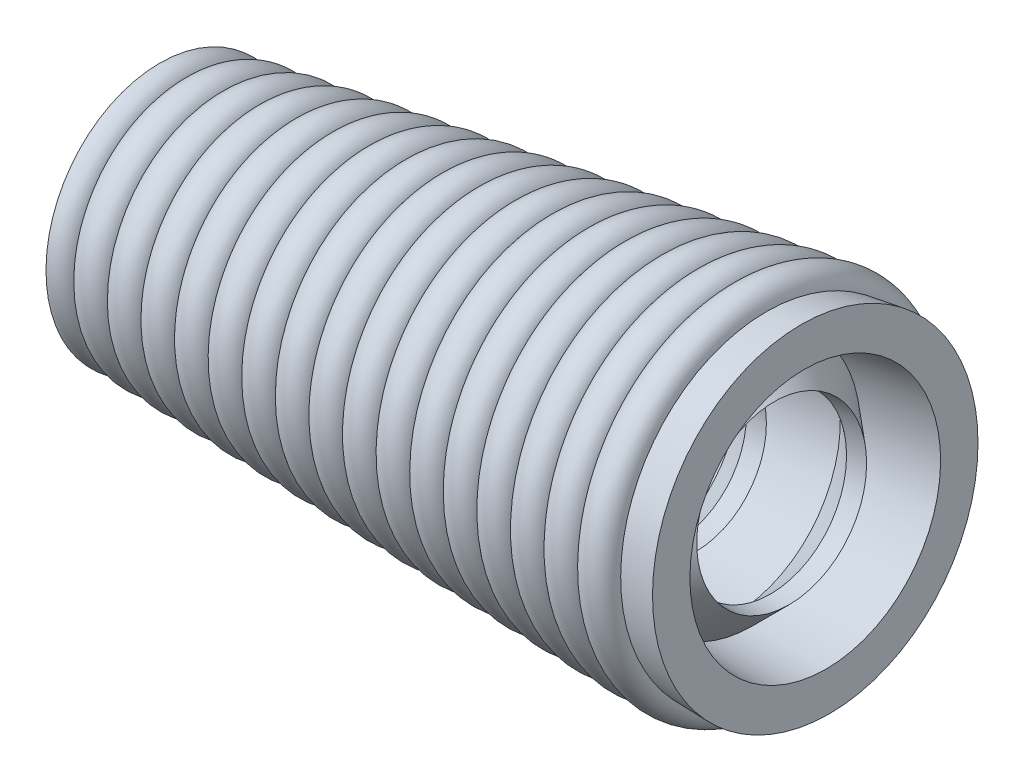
ISO-10303-21;
HEADER;
FILE_DESCRIPTION(('STEP AP214'),'2;1');
FILE_NAME('part.step','',(''),(''),'','','');
FILE_SCHEMA(('AUTOMOTIVE_DESIGN { 1 0 10303 214 1 1 1 1 }'));
ENDSEC;
DATA;
#1=APPLICATION_CONTEXT('core data for automotive mechanical design processes');
#2=APPLICATION_PROTOCOL_DEFINITION('international standard','automotive_design',2000,#1);
#3=PRODUCT_CONTEXT('',#1,'mechanical');
#4=PRODUCT('Part','Part','',(#3));
#5=PRODUCT_RELATED_PRODUCT_CATEGORY('part','',(#4));
#6=PRODUCT_DEFINITION_FORMATION('','',#4);
#7=PRODUCT_DEFINITION_CONTEXT('part definition',#1,'design');
#8=PRODUCT_DEFINITION('design','',#6,#7);
#9=PRODUCT_DEFINITION_SHAPE('','',#8);
#10=(LENGTH_UNIT() NAMED_UNIT(*) SI_UNIT(.MILLI.,.METRE.));
#11=(NAMED_UNIT(*) PLANE_ANGLE_UNIT() SI_UNIT($,.RADIAN.));
#12=(NAMED_UNIT(*) SI_UNIT($,.STERADIAN.) SOLID_ANGLE_UNIT());
#13=UNCERTAINTY_MEASURE_WITH_UNIT(LENGTH_MEASURE(1.E-05),#10,'distance_accuracy_value','');
#14=(GEOMETRIC_REPRESENTATION_CONTEXT(3) GLOBAL_UNCERTAINTY_ASSIGNED_CONTEXT((#13)) GLOBAL_UNIT_ASSIGNED_CONTEXT((#10,
#11,#12)) REPRESENTATION_CONTEXT('',''));
#15=CARTESIAN_POINT('',(0.,0.,0.));
#16=DIRECTION('',(0.,0.,1.));
#17=DIRECTION('',(1.,0.,0.));
#18=AXIS2_PLACEMENT_3D('',#15,#16,#17);
#19=CARTESIAN_POINT('',(200.828415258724,20.7573376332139,0.));
#20=DIRECTION('',(0.996194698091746,0.0871557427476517,0.));
#21=DIRECTION('',(-0.0871557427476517,0.996194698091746,0.));
#22=AXIS2_PLACEMENT_3D('',#19,#20,#21);
#23=CONICAL_SURFACE('',#22,27.2108832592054,0.0872664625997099);
#24=CARTESIAN_POINT('',(200.828415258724,20.7573376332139,0.));
#25=DIRECTION('',(-0.996194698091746,-0.0871557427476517,0.));
#26=DIRECTION('',(0.0871557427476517,-0.996194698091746,0.));
#27=AXIS2_PLACEMENT_3D('',#24,#25,#26);
#28=CIRCLE('',#27,27.2108832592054);
#29=CARTESIAN_POINT('',(203.2,-6.34999999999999,0.));
#30=VERTEX_POINT('',#29);
#31=EDGE_CURVE('E167',#30,#30,#28,.T.);
#32=ORIENTED_EDGE('',*,*,#31,.F.);
#33=EDGE_LOOP('',(#32));
#34=FACE_BOUND('',#33,.T.);
#35=CARTESIAN_POINT('',(206.799924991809,21.2797770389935,0.));
#36=DIRECTION('',(0.996194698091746,0.0871557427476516,0.));
#37=DIRECTION('',(-0.0871557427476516,0.996194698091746,0.));
#38=AXIS2_PLACEMENT_3D('',#35,#36,#37);
#39=CIRCLE('',#38,27.7353182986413);
#40=CARTESIAN_POINT('',(204.382632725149,48.909554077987,0.));
#41=VERTEX_POINT('',#40);
#42=EDGE_CURVE('E47',#41,#41,#39,.F.);
#43=ORIENTED_EDGE('',*,*,#42,.T.);
#44=EDGE_LOOP('',(#43));
#45=FACE_BOUND('',#44,.T.);
#46=ADVANCED_FACE('F43',(#34,#45),#23,.T.);
#47=CARTESIAN_POINT('',(103.372141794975,12.2310185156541,0.));
#48=DIRECTION('',(-0.996194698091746,-0.0871557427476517,0.));
#49=DIRECTION('',(0.0871557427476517,-0.996194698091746,0.));
#50=AXIS2_PLACEMENT_3D('',#47,#48,#49);
#51=CONICAL_SURFACE('',#50,5.9034830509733,0.69813170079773);
#52=CARTESIAN_POINT('',(96.5190442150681,11.6314501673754,0.));
#53=DIRECTION('',(0.996194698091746,0.0871557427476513,0.));
#54=DIRECTION('',(-0.0871557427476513,0.996194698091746,0.));
#55=AXIS2_PLACEMENT_3D('',#52,#53,#54);
#56=CIRCLE('',#55,11.6758804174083);
#57=CARTESIAN_POINT('',(95.5014241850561,23.2629003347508,0.));
#58=VERTEX_POINT('',#57);
#59=EDGE_CURVE('E235',#58,#58,#56,.T.);
#60=ORIENTED_EDGE('',*,*,#59,.F.);
#61=EDGE_LOOP('',(#60));
#62=FACE_BOUND('',#61,.T.);
#63=CARTESIAN_POINT('',(103.372141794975,12.2310185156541,0.));
#64=DIRECTION('',(-0.996194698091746,-0.0871557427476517,0.));
#65=DIRECTION('',(0.0871557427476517,-0.996194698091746,0.));
#66=AXIS2_PLACEMENT_3D('',#63,#64,#65);
#67=CIRCLE('',#66,5.9034830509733);
#68=CARTESIAN_POINT('',(103.88666424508,6.35,0.));
#69=VERTEX_POINT('',#68);
#70=EDGE_CURVE('E52',#69,#69,#67,.T.);
#71=ORIENTED_EDGE('',*,*,#70,.F.);
#72=EDGE_LOOP('',(#71));
#73=FACE_BOUND('',#72,.T.);
#74=ADVANCED_FACE('F45',(#62,#73),#51,.F.);
#75=CARTESIAN_POINT('',(106.523024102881,12.5066849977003,0.));
#76=DIRECTION('',(0.996194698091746,0.0871557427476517,0.));
#77=DIRECTION('',(-0.0871557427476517,0.996194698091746,0.));
#78=AXIS2_PLACEMENT_3D('',#75,#76,#77);
#79=CONICAL_SURFACE('',#78,6.18020253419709,0.08726646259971);
#80=ORIENTED_EDGE('',*,*,#70,.T.);
#81=EDGE_LOOP('',(#80));
#82=FACE_BOUND('',#81,.T.);
#83=CARTESIAN_POINT('',(106.523024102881,12.5066849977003,0.));
#84=DIRECTION('',(-0.996194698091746,-0.0871557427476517,0.));
#85=DIRECTION('',(0.0871557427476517,-0.996194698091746,0.));
#86=AXIS2_PLACEMENT_3D('',#83,#84,#85);
#87=CIRCLE('',#86,6.18020253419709);
#88=CARTESIAN_POINT('',(107.06166424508,6.35,0.));
#89=VERTEX_POINT('',#88);
#90=EDGE_CURVE('E57',#89,#89,#87,.T.);
#91=ORIENTED_EDGE('',*,*,#90,.F.);
#92=EDGE_LOOP('',(#91));
#93=FACE_BOUND('',#92,.T.);
#94=ADVANCED_FACE('F261',(#82,#93),#79,.F.);
#95=CARTESIAN_POINT('',(99.6699265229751,11.9071166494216,0.));
#96=DIRECTION('',(-0.996194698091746,-0.0871557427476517,0.));
#97=DIRECTION('',(0.0871557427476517,-0.996194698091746,0.));
#98=AXIS2_PLACEMENT_3D('',#95,#96,#97);
#99=CONICAL_SURFACE('',#98,11.9525999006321,0.698131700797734);
#100=ORIENTED_EDGE('',*,*,#90,.T.);
#101=EDGE_LOOP('',(#100));
#102=FACE_BOUND('',#101,.T.);
#103=CARTESIAN_POINT('',(99.6699265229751,11.9071166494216,0.));
#104=DIRECTION('',(-0.996194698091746,-0.0871557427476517,0.));
#105=DIRECTION('',(0.0871557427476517,-0.996194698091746,0.));
#106=AXIS2_PLACEMENT_3D('',#103,#104,#105);
#107=CIRCLE('',#106,11.9525999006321);
#108=CARTESIAN_POINT('',(100.71166424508,0.,0.));
#109=VERTEX_POINT('',#108);
#110=EDGE_CURVE('E63',#109,#109,#107,.T.);
#111=ORIENTED_EDGE('',*,*,#110,.F.);
#112=EDGE_LOOP('',(#111));
#113=FACE_BOUND('',#112,.T.);
#114=ADVANCED_FACE('F367',(#102,#113),#99,.T.);
#115=CARTESIAN_POINT('',(112.273455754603,13.0097825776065,0.));
#116=DIRECTION('',(0.996194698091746,0.0871557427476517,0.));
#117=DIRECTION('',(-0.0871557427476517,0.996194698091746,0.));
#118=AXIS2_PLACEMENT_3D('',#115,#116,#117);
#119=CONICAL_SURFACE('',#118,13.0594778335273,0.0872664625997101);
#120=ORIENTED_EDGE('',*,*,#110,.T.);
#121=EDGE_LOOP('',(#120));
#122=FACE_BOUND('',#121,.T.);
#123=CARTESIAN_POINT('',(112.273455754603,13.0097825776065,0.));
#124=DIRECTION('',(-0.996194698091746,-0.0871557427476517,0.));
#125=DIRECTION('',(0.0871557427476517,-0.996194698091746,0.));
#126=AXIS2_PLACEMENT_3D('',#123,#124,#125);
#127=CIRCLE('',#126,13.0594778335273);
#128=CARTESIAN_POINT('',(113.41166424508,0.,0.));
#129=VERTEX_POINT('',#128);
#130=EDGE_CURVE('E67',#129,#129,#127,.T.);
#131=ORIENTED_EDGE('',*,*,#130,.F.);
#132=EDGE_LOOP('',(#131));
#133=FACE_BOUND('',#132,.T.);
#134=ADVANCED_FACE('F363',(#122,#133),#119,.F.);
#135=CARTESIAN_POINT('',(119.126553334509,13.6093509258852,0.));
#136=DIRECTION('',(-0.996194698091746,-0.0871557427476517,0.));
#137=DIRECTION('',(0.0871557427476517,-0.996194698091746,0.));
#138=AXIS2_PLACEMENT_3D('',#135,#136,#137);
#139=CONICAL_SURFACE('',#138,7.28708046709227,0.698131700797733);
#140=ORIENTED_EDGE('',*,*,#130,.T.);
#141=EDGE_LOOP('',(#140));
#142=FACE_BOUND('',#141,.T.);
#143=CARTESIAN_POINT('',(119.126553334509,13.6093509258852,0.));
#144=DIRECTION('',(-0.996194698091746,-0.0871557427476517,0.));
#145=DIRECTION('',(0.0871557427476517,-0.996194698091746,0.));
#146=AXIS2_PLACEMENT_3D('',#143,#144,#145);
#147=CIRCLE('',#146,7.28708046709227);
#148=CARTESIAN_POINT('',(119.76166424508,6.35,0.));
#149=VERTEX_POINT('',#148);
#150=EDGE_CURVE('E71',#149,#149,#147,.T.);
#151=ORIENTED_EDGE('',*,*,#150,.F.);
#152=EDGE_LOOP('',(#151));
#153=FACE_BOUND('',#152,.T.);
#154=ADVANCED_FACE('F359',(#142,#153),#139,.F.);
#155=CARTESIAN_POINT('',(122.277435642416,13.8850174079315,0.));
#156=DIRECTION('',(0.996194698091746,0.0871557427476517,0.));
#157=DIRECTION('',(-0.0871557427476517,0.996194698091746,0.));
#158=AXIS2_PLACEMENT_3D('',#155,#156,#157);
#159=CONICAL_SURFACE('',#158,7.56379995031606,0.0872664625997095);
#160=ORIENTED_EDGE('',*,*,#150,.T.);
#161=EDGE_LOOP('',(#160));
#162=FACE_BOUND('',#161,.T.);
#163=CARTESIAN_POINT('',(122.277435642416,13.8850174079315,0.));
#164=DIRECTION('',(-0.996194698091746,-0.0871557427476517,0.));
#165=DIRECTION('',(0.0871557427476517,-0.996194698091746,0.));
#166=AXIS2_PLACEMENT_3D('',#163,#164,#165);
#167=CIRCLE('',#166,7.56379995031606);
#168=CARTESIAN_POINT('',(122.93666424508,6.35,0.));
#169=VERTEX_POINT('',#168);
#170=EDGE_CURVE('E75',#169,#169,#167,.T.);
#171=ORIENTED_EDGE('',*,*,#170,.F.);
#172=EDGE_LOOP('',(#171));
#173=FACE_BOUND('',#172,.T.);
#174=ADVANCED_FACE('F355',(#162,#173),#159,.F.);
#175=CARTESIAN_POINT('',(115.424338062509,13.2854490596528,0.));
#176=DIRECTION('',(-0.996194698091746,-0.0871557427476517,0.));
#177=DIRECTION('',(0.0871557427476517,-0.996194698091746,0.));
#178=AXIS2_PLACEMENT_3D('',#175,#176,#177);
#179=CONICAL_SURFACE('',#178,13.3361973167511,0.698131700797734);
#180=ORIENTED_EDGE('',*,*,#170,.T.);
#181=EDGE_LOOP('',(#180));
#182=FACE_BOUND('',#181,.T.);
#183=CARTESIAN_POINT('',(115.424338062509,13.2854490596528,0.));
#184=DIRECTION('',(-0.996194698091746,-0.0871557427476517,0.));
#185=DIRECTION('',(0.0871557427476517,-0.996194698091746,0.));
#186=AXIS2_PLACEMENT_3D('',#183,#184,#185);
#187=CIRCLE('',#186,13.3361973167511);
#188=CARTESIAN_POINT('',(116.58666424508,0.,0.));
#189=VERTEX_POINT('',#188);
#190=EDGE_CURVE('E79',#189,#189,#187,.T.);
#191=ORIENTED_EDGE('',*,*,#190,.F.);
#192=EDGE_LOOP('',(#191));
#193=FACE_BOUND('',#192,.T.);
#194=ADVANCED_FACE('F351',(#182,#193),#179,.T.);
#195=CARTESIAN_POINT('',(128.027867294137,14.3881149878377,0.));
#196=DIRECTION('',(0.996194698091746,0.0871557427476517,0.));
#197=DIRECTION('',(-0.0871557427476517,0.996194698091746,0.));
#198=AXIS2_PLACEMENT_3D('',#195,#196,#197);
#199=CONICAL_SURFACE('',#198,14.4430752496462,0.0872664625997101);
#200=ORIENTED_EDGE('',*,*,#190,.T.);
#201=EDGE_LOOP('',(#200));
#202=FACE_BOUND('',#201,.T.);
#203=CARTESIAN_POINT('',(128.027867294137,14.3881149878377,0.));
#204=DIRECTION('',(-0.996194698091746,-0.0871557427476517,0.));
#205=DIRECTION('',(0.0871557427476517,-0.996194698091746,0.));
#206=AXIS2_PLACEMENT_3D('',#203,#204,#205);
#207=CIRCLE('',#206,14.4430752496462);
#208=CARTESIAN_POINT('',(129.28666424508,0.,0.));
#209=VERTEX_POINT('',#208);
#210=EDGE_CURVE('E83',#209,#209,#207,.T.);
#211=ORIENTED_EDGE('',*,*,#210,.F.);
#212=EDGE_LOOP('',(#211));
#213=FACE_BOUND('',#212,.T.);
#214=ADVANCED_FACE('F347',(#202,#213),#199,.F.);
#215=CARTESIAN_POINT('',(134.880964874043,14.9876833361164,0.));
#216=DIRECTION('',(-0.996194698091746,-0.0871557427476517,0.));
#217=DIRECTION('',(0.0871557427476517,-0.996194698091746,0.));
#218=AXIS2_PLACEMENT_3D('',#215,#216,#217);
#219=CONICAL_SURFACE('',#218,8.67067788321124,0.698131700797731);
#220=ORIENTED_EDGE('',*,*,#210,.T.);
#221=EDGE_LOOP('',(#220));
#222=FACE_BOUND('',#221,.T.);
#223=CARTESIAN_POINT('',(134.880964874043,14.9876833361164,0.));
#224=DIRECTION('',(-0.996194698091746,-0.0871557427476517,0.));
#225=DIRECTION('',(0.0871557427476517,-0.996194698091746,0.));
#226=AXIS2_PLACEMENT_3D('',#223,#224,#225);
#227=CIRCLE('',#226,8.67067788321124);
#228=CARTESIAN_POINT('',(135.63666424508,6.35,0.));
#229=VERTEX_POINT('',#228);
#230=EDGE_CURVE('E87',#229,#229,#227,.T.);
#231=ORIENTED_EDGE('',*,*,#230,.F.);
#232=EDGE_LOOP('',(#231));
#233=FACE_BOUND('',#232,.T.);
#234=ADVANCED_FACE('F343',(#222,#233),#219,.F.);
#235=CARTESIAN_POINT('',(138.03184718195,15.2633498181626,0.));
#236=DIRECTION('',(0.996194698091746,0.0871557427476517,0.));
#237=DIRECTION('',(-0.0871557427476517,0.996194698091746,0.));
#238=AXIS2_PLACEMENT_3D('',#235,#236,#237);
#239=CONICAL_SURFACE('',#238,8.94739736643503,0.0872664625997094);
#240=ORIENTED_EDGE('',*,*,#230,.T.);
#241=EDGE_LOOP('',(#240));
#242=FACE_BOUND('',#241,.T.);
#243=CARTESIAN_POINT('',(138.03184718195,15.2633498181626,0.));
#244=DIRECTION('',(-0.996194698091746,-0.0871557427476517,0.));
#245=DIRECTION('',(0.0871557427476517,-0.996194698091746,0.));
#246=AXIS2_PLACEMENT_3D('',#243,#244,#245);
#247=CIRCLE('',#246,8.94739736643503);
#248=CARTESIAN_POINT('',(138.81166424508,6.35,0.));
#249=VERTEX_POINT('',#248);
#250=EDGE_CURVE('E91',#249,#249,#247,.T.);
#251=ORIENTED_EDGE('',*,*,#250,.F.);
#252=EDGE_LOOP('',(#251));
#253=FACE_BOUND('',#252,.T.);
#254=ADVANCED_FACE('F339',(#242,#253),#239,.F.);
#255=CARTESIAN_POINT('',(131.178749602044,14.6637814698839,0.));
#256=DIRECTION('',(-0.996194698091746,-0.0871557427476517,0.));
#257=DIRECTION('',(0.0871557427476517,-0.996194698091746,0.));
#258=AXIS2_PLACEMENT_3D('',#255,#256,#257);
#259=CONICAL_SURFACE('',#258,14.71979473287,0.698131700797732);
#260=ORIENTED_EDGE('',*,*,#250,.T.);
#261=EDGE_LOOP('',(#260));
#262=FACE_BOUND('',#261,.T.);
#263=CARTESIAN_POINT('',(131.178749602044,14.6637814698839,0.));
#264=DIRECTION('',(-0.996194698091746,-0.0871557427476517,0.));
#265=DIRECTION('',(0.0871557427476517,-0.996194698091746,0.));
#266=AXIS2_PLACEMENT_3D('',#263,#264,#265);
#267=CIRCLE('',#266,14.71979473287);
#268=CARTESIAN_POINT('',(132.46166424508,0.,0.));
#269=VERTEX_POINT('',#268);
#270=EDGE_CURVE('E95',#269,#269,#267,.T.);
#271=ORIENTED_EDGE('',*,*,#270,.F.);
#272=EDGE_LOOP('',(#271));
#273=FACE_BOUND('',#272,.T.);
#274=ADVANCED_FACE('F335',(#262,#273),#259,.T.);
#275=CARTESIAN_POINT('',(143.782278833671,15.7664473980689,0.));
#276=DIRECTION('',(0.996194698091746,0.0871557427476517,0.));
#277=DIRECTION('',(-0.0871557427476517,0.996194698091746,0.));
#278=AXIS2_PLACEMENT_3D('',#275,#276,#277);
#279=CONICAL_SURFACE('',#278,15.8266726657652,0.0872664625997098);
#280=ORIENTED_EDGE('',*,*,#270,.T.);
#281=EDGE_LOOP('',(#280));
#282=FACE_BOUND('',#281,.T.);
#283=CARTESIAN_POINT('',(143.782278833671,15.7664473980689,0.));
#284=DIRECTION('',(-0.996194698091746,-0.0871557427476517,0.));
#285=DIRECTION('',(0.0871557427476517,-0.996194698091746,0.));
#286=AXIS2_PLACEMENT_3D('',#283,#284,#285);
#287=CIRCLE('',#286,15.8266726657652);
#288=CARTESIAN_POINT('',(145.16166424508,0.,0.));
#289=VERTEX_POINT('',#288);
#290=EDGE_CURVE('E99',#289,#289,#287,.T.);
#291=ORIENTED_EDGE('',*,*,#290,.F.);
#292=EDGE_LOOP('',(#291));
#293=FACE_BOUND('',#292,.T.);
#294=ADVANCED_FACE('F331',(#282,#293),#279,.F.);
#295=CARTESIAN_POINT('',(150.635376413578,16.3660157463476,0.));
#296=DIRECTION('',(-0.996194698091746,-0.0871557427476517,0.));
#297=DIRECTION('',(0.0871557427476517,-0.996194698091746,0.));
#298=AXIS2_PLACEMENT_3D('',#295,#296,#297);
#299=CONICAL_SURFACE('',#298,10.0542752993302,0.698131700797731);
#300=ORIENTED_EDGE('',*,*,#290,.T.);
#301=EDGE_LOOP('',(#300));
#302=FACE_BOUND('',#301,.T.);
#303=CARTESIAN_POINT('',(150.635376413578,16.3660157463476,0.));
#304=DIRECTION('',(-0.996194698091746,-0.0871557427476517,0.));
#305=DIRECTION('',(0.0871557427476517,-0.996194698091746,0.));
#306=AXIS2_PLACEMENT_3D('',#303,#304,#305);
#307=CIRCLE('',#306,10.0542752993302);
#308=CARTESIAN_POINT('',(151.51166424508,6.35,0.));
#309=VERTEX_POINT('',#308);
#310=EDGE_CURVE('E103',#309,#309,#307,.T.);
#311=ORIENTED_EDGE('',*,*,#310,.F.);
#312=EDGE_LOOP('',(#311));
#313=FACE_BOUND('',#312,.T.);
#314=ADVANCED_FACE('F327',(#302,#313),#299,.F.);
#315=CARTESIAN_POINT('',(153.786258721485,16.6416822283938,0.));
#316=DIRECTION('',(0.996194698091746,0.0871557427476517,0.));
#317=DIRECTION('',(-0.0871557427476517,0.996194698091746,0.));
#318=AXIS2_PLACEMENT_3D('',#315,#316,#317);
#319=CONICAL_SURFACE('',#318,10.330994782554,0.0872664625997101);
#320=ORIENTED_EDGE('',*,*,#310,.T.);
#321=EDGE_LOOP('',(#320));
#322=FACE_BOUND('',#321,.T.);
#323=CARTESIAN_POINT('',(153.786258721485,16.6416822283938,0.));
#324=DIRECTION('',(-0.996194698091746,-0.0871557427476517,0.));
#325=DIRECTION('',(0.0871557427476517,-0.996194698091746,0.));
#326=AXIS2_PLACEMENT_3D('',#323,#324,#325);
#327=CIRCLE('',#326,10.330994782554);
#328=CARTESIAN_POINT('',(154.68666424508,6.35,0.));
#329=VERTEX_POINT('',#328);
#330=EDGE_CURVE('E107',#329,#329,#327,.T.);
#331=ORIENTED_EDGE('',*,*,#330,.F.);
#332=EDGE_LOOP('',(#331));
#333=FACE_BOUND('',#332,.T.);
#334=ADVANCED_FACE('F323',(#322,#333),#319,.F.);
#335=CARTESIAN_POINT('',(146.933161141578,16.0421138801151,0.));
#336=DIRECTION('',(-0.996194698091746,-0.0871557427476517,0.));
#337=DIRECTION('',(0.0871557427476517,-0.996194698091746,0.));
#338=AXIS2_PLACEMENT_3D('',#335,#336,#337);
#339=CONICAL_SURFACE('',#338,16.103392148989,0.698131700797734);
#340=ORIENTED_EDGE('',*,*,#330,.T.);
#341=EDGE_LOOP('',(#340));
#342=FACE_BOUND('',#341,.T.);
#343=CARTESIAN_POINT('',(146.933161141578,16.0421138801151,0.));
#344=DIRECTION('',(-0.996194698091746,-0.0871557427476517,0.));
#345=DIRECTION('',(0.0871557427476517,-0.996194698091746,0.));
#346=AXIS2_PLACEMENT_3D('',#343,#344,#345);
#347=CIRCLE('',#346,16.103392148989);
#348=CARTESIAN_POINT('',(148.33666424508,0.,0.));
#349=VERTEX_POINT('',#348);
#350=EDGE_CURVE('E111',#349,#349,#347,.T.);
#351=ORIENTED_EDGE('',*,*,#350,.F.);
#352=EDGE_LOOP('',(#351));
#353=FACE_BOUND('',#352,.T.);
#354=ADVANCED_FACE('F319',(#342,#353),#339,.T.);
#355=CARTESIAN_POINT('',(159.536690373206,17.1447798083,0.));
#356=DIRECTION('',(0.996194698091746,0.0871557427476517,0.));
#357=DIRECTION('',(-0.0871557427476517,0.996194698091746,0.));
#358=AXIS2_PLACEMENT_3D('',#355,#356,#357);
#359=CONICAL_SURFACE('',#358,17.2102700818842,0.0872664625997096);
#360=ORIENTED_EDGE('',*,*,#350,.T.);
#361=EDGE_LOOP('',(#360));
#362=FACE_BOUND('',#361,.T.);
#363=CARTESIAN_POINT('',(159.536690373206,17.1447798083,0.));
#364=DIRECTION('',(-0.996194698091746,-0.0871557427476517,0.));
#365=DIRECTION('',(0.0871557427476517,-0.996194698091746,0.));
#366=AXIS2_PLACEMENT_3D('',#363,#364,#365);
#367=CIRCLE('',#366,17.2102700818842);
#368=CARTESIAN_POINT('',(161.03666424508,0.,0.));
#369=VERTEX_POINT('',#368);
#370=EDGE_CURVE('E115',#369,#369,#367,.T.);
#371=ORIENTED_EDGE('',*,*,#370,.F.);
#372=EDGE_LOOP('',(#371));
#373=FACE_BOUND('',#372,.T.);
#374=ADVANCED_FACE('F315',(#362,#373),#359,.F.);
#375=CARTESIAN_POINT('',(166.389787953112,17.7443481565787,0.));
#376=DIRECTION('',(-0.996194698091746,-0.0871557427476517,0.));
#377=DIRECTION('',(0.0871557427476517,-0.996194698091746,0.));
#378=AXIS2_PLACEMENT_3D('',#375,#376,#377);
#379=CONICAL_SURFACE('',#378,11.4378727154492,0.698131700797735);
#380=ORIENTED_EDGE('',*,*,#370,.T.);
#381=EDGE_LOOP('',(#380));
#382=FACE_BOUND('',#381,.T.);
#383=CARTESIAN_POINT('',(166.389787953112,17.7443481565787,0.));
#384=DIRECTION('',(-0.996194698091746,-0.0871557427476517,0.));
#385=DIRECTION('',(0.0871557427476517,-0.996194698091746,0.));
#386=AXIS2_PLACEMENT_3D('',#383,#384,#385);
#387=CIRCLE('',#386,11.4378727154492);
#388=CARTESIAN_POINT('',(167.38666424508,6.35,0.));
#389=VERTEX_POINT('',#388);
#390=EDGE_CURVE('E119',#389,#389,#387,.T.);
#391=ORIENTED_EDGE('',*,*,#390,.F.);
#392=EDGE_LOOP('',(#391));
#393=FACE_BOUND('',#392,.T.);
#394=ADVANCED_FACE('F311',(#382,#393),#379,.F.);
#395=CARTESIAN_POINT('',(169.540670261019,18.0200146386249,0.));
#396=DIRECTION('',(0.996194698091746,0.0871557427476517,0.));
#397=DIRECTION('',(-0.0871557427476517,0.996194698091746,0.));
#398=AXIS2_PLACEMENT_3D('',#395,#396,#397);
#399=CONICAL_SURFACE('',#398,11.714592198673,0.0872664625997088);
#400=ORIENTED_EDGE('',*,*,#390,.T.);
#401=EDGE_LOOP('',(#400));
#402=FACE_BOUND('',#401,.T.);
#403=CARTESIAN_POINT('',(169.540670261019,18.0200146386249,0.));
#404=DIRECTION('',(-0.996194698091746,-0.0871557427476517,0.));
#405=DIRECTION('',(0.0871557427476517,-0.996194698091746,0.));
#406=AXIS2_PLACEMENT_3D('',#403,#404,#405);
#407=CIRCLE('',#406,11.714592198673);
#408=CARTESIAN_POINT('',(170.56166424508,6.35,0.));
#409=VERTEX_POINT('',#408);
#410=EDGE_CURVE('E123',#409,#409,#407,.T.);
#411=ORIENTED_EDGE('',*,*,#410,.F.);
#412=EDGE_LOOP('',(#411));
#413=FACE_BOUND('',#412,.T.);
#414=ADVANCED_FACE('F307',(#402,#413),#399,.F.);
#415=CARTESIAN_POINT('',(162.687572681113,17.4204462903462,0.));
#416=DIRECTION('',(-0.996194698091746,-0.0871557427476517,0.));
#417=DIRECTION('',(0.0871557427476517,-0.996194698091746,0.));
#418=AXIS2_PLACEMENT_3D('',#415,#416,#417);
#419=CONICAL_SURFACE('',#418,17.486989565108,0.698131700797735);
#420=ORIENTED_EDGE('',*,*,#410,.T.);
#421=EDGE_LOOP('',(#420));
#422=FACE_BOUND('',#421,.T.);
#423=CARTESIAN_POINT('',(162.687572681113,17.4204462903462,0.));
#424=DIRECTION('',(-0.996194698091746,-0.0871557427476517,0.));
#425=DIRECTION('',(0.0871557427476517,-0.996194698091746,0.));
#426=AXIS2_PLACEMENT_3D('',#423,#424,#425);
#427=CIRCLE('',#426,17.486989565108);
#428=CARTESIAN_POINT('',(164.21166424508,0.,0.));
#429=VERTEX_POINT('',#428);
#430=EDGE_CURVE('E127',#429,#429,#427,.T.);
#431=ORIENTED_EDGE('',*,*,#430,.F.);
#432=EDGE_LOOP('',(#431));
#433=FACE_BOUND('',#432,.T.);
#434=ADVANCED_FACE('F303',(#422,#433),#419,.T.);
#435=CARTESIAN_POINT('',(175.29110191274,18.5231122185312,0.));
#436=DIRECTION('',(0.996194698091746,0.0871557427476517,0.));
#437=DIRECTION('',(-0.0871557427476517,0.996194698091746,0.));
#438=AXIS2_PLACEMENT_3D('',#435,#436,#437);
#439=CONICAL_SURFACE('',#438,18.5938674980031,0.0872664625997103);
#440=ORIENTED_EDGE('',*,*,#430,.T.);
#441=EDGE_LOOP('',(#440));
#442=FACE_BOUND('',#441,.T.);
#443=CARTESIAN_POINT('',(175.29110191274,18.5231122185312,0.));
#444=DIRECTION('',(-0.996194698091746,-0.0871557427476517,0.));
#445=DIRECTION('',(0.0871557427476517,-0.996194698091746,0.));
#446=AXIS2_PLACEMENT_3D('',#443,#444,#445);
#447=CIRCLE('',#446,18.5938674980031);
#448=CARTESIAN_POINT('',(176.91166424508,0.,0.));
#449=VERTEX_POINT('',#448);
#450=EDGE_CURVE('E131',#449,#449,#447,.T.);
#451=ORIENTED_EDGE('',*,*,#450,.F.);
#452=EDGE_LOOP('',(#451));
#453=FACE_BOUND('',#452,.T.);
#454=ADVANCED_FACE('F299',(#442,#453),#439,.F.);
#455=CARTESIAN_POINT('',(182.144199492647,19.1226805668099,0.));
#456=DIRECTION('',(-0.996194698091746,-0.0871557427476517,0.));
#457=DIRECTION('',(0.0871557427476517,-0.996194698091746,0.));
#458=AXIS2_PLACEMENT_3D('',#455,#456,#457);
#459=CONICAL_SURFACE('',#458,12.8214701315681,0.698131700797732);
#460=ORIENTED_EDGE('',*,*,#450,.T.);
#461=EDGE_LOOP('',(#460));
#462=FACE_BOUND('',#461,.T.);
#463=CARTESIAN_POINT('',(182.144199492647,19.1226805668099,0.));
#464=DIRECTION('',(-0.996194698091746,-0.0871557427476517,0.));
#465=DIRECTION('',(0.0871557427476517,-0.996194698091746,0.));
#466=AXIS2_PLACEMENT_3D('',#463,#464,#465);
#467=CIRCLE('',#466,12.8214701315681);
#468=CARTESIAN_POINT('',(183.26166424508,6.35,0.));
#469=VERTEX_POINT('',#468);
#470=EDGE_CURVE('E135',#469,#469,#467,.T.);
#471=ORIENTED_EDGE('',*,*,#470,.F.);
#472=EDGE_LOOP('',(#471));
#473=FACE_BOUND('',#472,.T.);
#474=ADVANCED_FACE('F295',(#462,#473),#459,.F.);
#475=CARTESIAN_POINT('',(185.295081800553,19.3983470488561,0.));
#476=DIRECTION('',(0.996194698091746,0.0871557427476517,0.));
#477=DIRECTION('',(-0.0871557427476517,0.996194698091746,0.));
#478=AXIS2_PLACEMENT_3D('',#475,#476,#477);
#479=CONICAL_SURFACE('',#478,13.0981896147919,0.0872664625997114);
#480=ORIENTED_EDGE('',*,*,#470,.T.);
#481=EDGE_LOOP('',(#480));
#482=FACE_BOUND('',#481,.T.);
#483=CARTESIAN_POINT('',(185.295081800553,19.3983470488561,0.));
#484=DIRECTION('',(-0.996194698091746,-0.0871557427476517,0.));
#485=DIRECTION('',(0.0871557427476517,-0.996194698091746,0.));
#486=AXIS2_PLACEMENT_3D('',#483,#484,#485);
#487=CIRCLE('',#486,13.0981896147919);
#488=CARTESIAN_POINT('',(186.43666424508,6.35,0.));
#489=VERTEX_POINT('',#488);
#490=EDGE_CURVE('E139',#489,#489,#487,.T.);
#491=ORIENTED_EDGE('',*,*,#490,.F.);
#492=EDGE_LOOP('',(#491));
#493=FACE_BOUND('',#492,.T.);
#494=ADVANCED_FACE('F291',(#482,#493),#479,.F.);
#495=CARTESIAN_POINT('',(178.441984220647,18.7987787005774,0.));
#496=DIRECTION('',(-0.996194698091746,-0.0871557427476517,0.));
#497=DIRECTION('',(0.0871557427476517,-0.996194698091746,0.));
#498=AXIS2_PLACEMENT_3D('',#495,#496,#497);
#499=CONICAL_SURFACE('',#498,18.8705869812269,0.698131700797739);
#500=ORIENTED_EDGE('',*,*,#490,.T.);
#501=EDGE_LOOP('',(#500));
#502=FACE_BOUND('',#501,.T.);
#503=CARTESIAN_POINT('',(178.441984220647,18.7987787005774,0.));
#504=DIRECTION('',(-0.996194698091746,-0.0871557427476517,0.));
#505=DIRECTION('',(0.0871557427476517,-0.996194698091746,0.));
#506=AXIS2_PLACEMENT_3D('',#503,#504,#505);
#507=CIRCLE('',#506,18.8705869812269);
#508=CARTESIAN_POINT('',(180.08666424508,0.,0.));
#509=VERTEX_POINT('',#508);
#510=EDGE_CURVE('E143',#509,#509,#507,.T.);
#511=ORIENTED_EDGE('',*,*,#510,.F.);
#512=EDGE_LOOP('',(#511));
#513=FACE_BOUND('',#512,.T.);
#514=ADVANCED_FACE('F287',(#502,#513),#499,.T.);
#515=CARTESIAN_POINT('',(191.045513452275,19.9014446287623,0.));
#516=DIRECTION('',(0.996194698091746,0.0871557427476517,0.));
#517=DIRECTION('',(-0.0871557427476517,0.996194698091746,0.));
#518=AXIS2_PLACEMENT_3D('',#515,#516,#517);
#519=CONICAL_SURFACE('',#518,19.9774649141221,0.0872664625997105);
#520=ORIENTED_EDGE('',*,*,#510,.T.);
#521=EDGE_LOOP('',(#520));
#522=FACE_BOUND('',#521,.T.);
#523=CARTESIAN_POINT('',(191.045513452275,19.9014446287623,0.));
#524=DIRECTION('',(-0.996194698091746,-0.0871557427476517,0.));
#525=DIRECTION('',(0.0871557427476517,-0.996194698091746,0.));
#526=AXIS2_PLACEMENT_3D('',#523,#524,#525);
#527=CIRCLE('',#526,19.9774649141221);
#528=CARTESIAN_POINT('',(192.78666424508,0.,0.));
#529=VERTEX_POINT('',#528);
#530=EDGE_CURVE('E147',#529,#529,#527,.T.);
#531=ORIENTED_EDGE('',*,*,#530,.F.);
#532=EDGE_LOOP('',(#531));
#533=FACE_BOUND('',#532,.T.);
#534=ADVANCED_FACE('F283',(#522,#533),#519,.F.);
#535=CARTESIAN_POINT('',(197.898611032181,20.501012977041,0.));
#536=DIRECTION('',(-0.996194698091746,-0.0871557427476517,0.));
#537=DIRECTION('',(0.0871557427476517,-0.996194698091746,0.));
#538=AXIS2_PLACEMENT_3D('',#535,#536,#537);
#539=CONICAL_SURFACE('',#538,14.2050675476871,0.698131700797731);
#540=ORIENTED_EDGE('',*,*,#530,.T.);
#541=EDGE_LOOP('',(#540));
#542=FACE_BOUND('',#541,.T.);
#543=CARTESIAN_POINT('',(197.898611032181,20.501012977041,0.));
#544=DIRECTION('',(-0.996194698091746,-0.0871557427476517,0.));
#545=DIRECTION('',(0.0871557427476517,-0.996194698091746,0.));
#546=AXIS2_PLACEMENT_3D('',#543,#544,#545);
#547=CIRCLE('',#546,14.2050675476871);
#548=CARTESIAN_POINT('',(199.13666424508,6.35,0.));
#549=VERTEX_POINT('',#548);
#550=EDGE_CURVE('E151',#549,#549,#547,.T.);
#551=ORIENTED_EDGE('',*,*,#550,.F.);
#552=EDGE_LOOP('',(#551));
#553=FACE_BOUND('',#552,.T.);
#554=ADVANCED_FACE('F279',(#542,#553),#539,.F.);
#555=CARTESIAN_POINT('',(201.049493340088,20.7766794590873,0.));
#556=DIRECTION('',(0.996194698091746,0.0871557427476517,0.));
#557=DIRECTION('',(-0.0871557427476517,0.996194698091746,0.));
#558=AXIS2_PLACEMENT_3D('',#555,#556,#557);
#559=CONICAL_SURFACE('',#558,14.4817870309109,0.0872664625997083);
#560=ORIENTED_EDGE('',*,*,#550,.T.);
#561=EDGE_LOOP('',(#560));
#562=FACE_BOUND('',#561,.T.);
#563=CARTESIAN_POINT('',(201.049493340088,20.7766794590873,0.));
#564=DIRECTION('',(-0.996194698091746,-0.0871557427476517,0.));
#565=DIRECTION('',(0.0871557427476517,-0.996194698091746,0.));
#566=AXIS2_PLACEMENT_3D('',#563,#564,#565);
#567=CIRCLE('',#566,14.4817870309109);
#568=CARTESIAN_POINT('',(202.31166424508,6.35,0.));
#569=VERTEX_POINT('',#568);
#570=EDGE_CURVE('E155',#569,#569,#567,.T.);
#571=ORIENTED_EDGE('',*,*,#570,.F.);
#572=EDGE_LOOP('',(#571));
#573=FACE_BOUND('',#572,.T.);
#574=ADVANCED_FACE('F275',(#562,#573),#559,.F.);
#575=CARTESIAN_POINT('',(194.196395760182,20.1771111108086,0.));
#576=DIRECTION('',(-0.996194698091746,-0.0871557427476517,0.));
#577=DIRECTION('',(0.0871557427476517,-0.996194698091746,0.));
#578=AXIS2_PLACEMENT_3D('',#575,#576,#577);
#579=CONICAL_SURFACE('',#578,20.2541843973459,0.698131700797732);
#580=ORIENTED_EDGE('',*,*,#570,.T.);
#581=EDGE_LOOP('',(#580));
#582=FACE_BOUND('',#581,.T.);
#583=CARTESIAN_POINT('',(194.196395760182,20.1771111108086,0.));
#584=DIRECTION('',(-0.996194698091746,-0.0871557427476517,0.));
#585=DIRECTION('',(0.0871557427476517,-0.996194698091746,0.));
#586=AXIS2_PLACEMENT_3D('',#583,#584,#585);
#587=CIRCLE('',#586,20.2541843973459);
#588=CARTESIAN_POINT('',(195.96166424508,0.,0.));
#589=VERTEX_POINT('',#588);
#590=EDGE_CURVE('E159',#589,#589,#587,.T.);
#591=ORIENTED_EDGE('',*,*,#590,.F.);
#592=EDGE_LOOP('',(#591));
#593=FACE_BOUND('',#592,.T.);
#594=ADVANCED_FACE('F271',(#582,#593),#579,.T.);
#595=CARTESIAN_POINT('',(206.799924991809,21.2797770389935,0.));
#596=DIRECTION('',(0.996194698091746,0.0871557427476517,0.));
#597=DIRECTION('',(-0.0871557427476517,0.996194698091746,0.));
#598=AXIS2_PLACEMENT_3D('',#595,#596,#597);
#599=CONICAL_SURFACE('',#598,21.3610623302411,0.0872664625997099);
#600=ORIENTED_EDGE('',*,*,#590,.T.);
#601=EDGE_LOOP('',(#600));
#602=FACE_BOUND('',#601,.T.);
#603=CARTESIAN_POINT('',(206.799924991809,21.2797770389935,0.));
#604=DIRECTION('',(-0.996194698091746,-0.0871557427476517,0.));
#605=DIRECTION('',(0.0871557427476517,-0.996194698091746,0.));
#606=AXIS2_PLACEMENT_3D('',#603,#604,#605);
#607=CIRCLE('',#606,21.3610623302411);
#608=CARTESIAN_POINT('',(208.66166424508,0.,0.));
#609=VERTEX_POINT('',#608);
#610=EDGE_CURVE('E163',#609,#609,#607,.T.);
#611=ORIENTED_EDGE('',*,*,#610,.F.);
#612=EDGE_LOOP('',(#611));
#613=FACE_BOUND('',#612,.T.);
#614=ADVANCED_FACE('F268',(#602,#613),#599,.F.);
#615=CARTESIAN_POINT('',(197.677532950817,20.4816711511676,0.));
#616=DIRECTION('',(-0.996194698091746,-0.0871557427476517,0.));
#617=DIRECTION('',(0.0871557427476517,-0.996194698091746,0.));
#618=AXIS2_PLACEMENT_3D('',#615,#616,#617);
#619=TOROIDAL_SURFACE('',#618,26.9341637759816,3.17499999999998);
#620=ORIENTED_EDGE('',*,*,#31,.T.);
#621=EDGE_LOOP('',(#620));
#622=FACE_BOUND('',#621,.T.);
#623=CARTESIAN_POINT('',(194.52665064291,20.2060046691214,0.));
#624=DIRECTION('',(-0.996194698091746,-0.0871557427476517,0.));
#625=DIRECTION('',(0.0871557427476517,-0.996194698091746,0.));
#626=AXIS2_PLACEMENT_3D('',#623,#624,#625);
#627=CIRCLE('',#626,26.6574442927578);
#628=CARTESIAN_POINT('',(196.85,-6.34999999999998,0.));
#629=VERTEX_POINT('',#628);
#630=EDGE_CURVE('E171',#629,#629,#627,.T.);
#631=ORIENTED_EDGE('',*,*,#630,.F.);
#632=EDGE_LOOP('',(#631));
#633=FACE_BOUND('',#632,.T.);
#634=ADVANCED_FACE('F266',(#622,#633),#619,.T.);
#635=CARTESIAN_POINT('',(191.375768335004,19.9303381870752,0.));
#636=DIRECTION('',(-0.996194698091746,-0.0871557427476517,0.));
#637=DIRECTION('',(0.0871557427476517,-0.996194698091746,0.));
#638=AXIS2_PLACEMENT_3D('',#635,#636,#637);
#639=TOROIDAL_SURFACE('',#638,26.380724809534,3.17500000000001);
#640=ORIENTED_EDGE('',*,*,#630,.T.);
#641=EDGE_LOOP('',(#640));
#642=FACE_BOUND('',#641,.T.);
#643=CARTESIAN_POINT('',(188.224886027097,19.654671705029,0.));
#644=DIRECTION('',(-0.996194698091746,-0.0871557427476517,0.));
#645=DIRECTION('',(0.0871557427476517,-0.996194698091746,0.));
#646=AXIS2_PLACEMENT_3D('',#643,#644,#645);
#647=CIRCLE('',#646,26.1040053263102);
#648=CARTESIAN_POINT('',(190.5,-6.34999999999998,0.));
#649=VERTEX_POINT('',#648);
#650=EDGE_CURVE('E175',#649,#649,#647,.T.);
#651=ORIENTED_EDGE('',*,*,#650,.F.);
#652=EDGE_LOOP('',(#651));
#653=FACE_BOUND('',#652,.T.);
#654=ADVANCED_FACE('F543',(#642,#653),#639,.T.);
#655=CARTESIAN_POINT('',(185.07400371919,19.3790052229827,0.));
#656=DIRECTION('',(-0.996194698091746,-0.0871557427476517,0.));
#657=DIRECTION('',(0.0871557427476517,-0.996194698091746,0.));
#658=AXIS2_PLACEMENT_3D('',#655,#656,#657);
#659=TOROIDAL_SURFACE('',#658,25.8272858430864,3.17499999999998);
#660=ORIENTED_EDGE('',*,*,#650,.T.);
#661=EDGE_LOOP('',(#660));
#662=FACE_BOUND('',#661,.T.);
#663=CARTESIAN_POINT('',(181.923121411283,19.1033387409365,0.));
#664=DIRECTION('',(-0.996194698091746,-0.0871557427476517,0.));
#665=DIRECTION('',(0.0871557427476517,-0.996194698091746,0.));
#666=AXIS2_PLACEMENT_3D('',#663,#664,#665);
#667=CIRCLE('',#666,25.5505663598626);
#668=CARTESIAN_POINT('',(184.15,-6.34999999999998,0.));
#669=VERTEX_POINT('',#668);
#670=EDGE_CURVE('E179',#669,#669,#667,.T.);
#671=ORIENTED_EDGE('',*,*,#670,.F.);
#672=EDGE_LOOP('',(#671));
#673=FACE_BOUND('',#672,.T.);
#674=ADVANCED_FACE('F550',(#662,#673),#659,.T.);
#675=CARTESIAN_POINT('',(178.772239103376,18.8276722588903,0.));
#676=DIRECTION('',(-0.996194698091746,-0.0871557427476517,0.));
#677=DIRECTION('',(0.0871557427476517,-0.996194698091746,0.));
#678=AXIS2_PLACEMENT_3D('',#675,#676,#677);
#679=TOROIDAL_SURFACE('',#678,25.2738468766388,3.17500000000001);
#680=ORIENTED_EDGE('',*,*,#670,.T.);
#681=EDGE_LOOP('',(#680));
#682=FACE_BOUND('',#681,.T.);
#683=CARTESIAN_POINT('',(175.621356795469,18.552005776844,0.));
#684=DIRECTION('',(-0.996194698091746,-0.0871557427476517,0.));
#685=DIRECTION('',(0.0871557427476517,-0.996194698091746,0.));
#686=AXIS2_PLACEMENT_3D('',#683,#684,#685);
#687=CIRCLE('',#686,24.997127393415);
#688=CARTESIAN_POINT('',(177.8,-6.34999999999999,0.));
#689=VERTEX_POINT('',#688);
#690=EDGE_CURVE('E183',#689,#689,#687,.T.);
#691=ORIENTED_EDGE('',*,*,#690,.F.);
#692=EDGE_LOOP('',(#691));
#693=FACE_BOUND('',#692,.T.);
#694=ADVANCED_FACE('F557',(#682,#693),#679,.T.);
#695=CARTESIAN_POINT('',(172.470474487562,18.2763392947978,0.));
#696=DIRECTION('',(-0.996194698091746,-0.0871557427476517,0.));
#697=DIRECTION('',(0.0871557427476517,-0.996194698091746,0.));
#698=AXIS2_PLACEMENT_3D('',#695,#696,#697);
#699=TOROIDAL_SURFACE('',#698,24.7204079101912,3.17499999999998);
#700=ORIENTED_EDGE('',*,*,#690,.T.);
#701=EDGE_LOOP('',(#700));
#702=FACE_BOUND('',#701,.T.);
#703=CARTESIAN_POINT('',(169.319592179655,18.0006728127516,0.));
#704=DIRECTION('',(-0.996194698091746,-0.0871557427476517,0.));
#705=DIRECTION('',(0.0871557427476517,-0.996194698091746,0.));
#706=AXIS2_PLACEMENT_3D('',#703,#704,#705);
#707=CIRCLE('',#706,24.4436884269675);
#708=CARTESIAN_POINT('',(171.45,-6.34999999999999,0.));
#709=VERTEX_POINT('',#708);
#710=EDGE_CURVE('E187',#709,#709,#707,.T.);
#711=ORIENTED_EDGE('',*,*,#710,.F.);
#712=EDGE_LOOP('',(#711));
#713=FACE_BOUND('',#712,.T.);
#714=ADVANCED_FACE('F565',(#702,#713),#699,.T.);
#715=CARTESIAN_POINT('',(166.168709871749,17.7250063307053,0.));
#716=DIRECTION('',(-0.996194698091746,-0.0871557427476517,0.));
#717=DIRECTION('',(0.0871557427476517,-0.996194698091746,0.));
#718=AXIS2_PLACEMENT_3D('',#715,#716,#717);
#719=TOROIDAL_SURFACE('',#718,24.1669689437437,3.17500000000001);
#720=ORIENTED_EDGE('',*,*,#710,.T.);
#721=EDGE_LOOP('',(#720));
#722=FACE_BOUND('',#721,.T.);
#723=CARTESIAN_POINT('',(163.017827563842,17.4493398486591,0.));
#724=DIRECTION('',(-0.996194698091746,-0.0871557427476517,0.));
#725=DIRECTION('',(0.0871557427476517,-0.996194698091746,0.));
#726=AXIS2_PLACEMENT_3D('',#723,#724,#725);
#727=CIRCLE('',#726,23.8902494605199);
#728=CARTESIAN_POINT('',(165.1,-6.34999999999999,0.));
#729=VERTEX_POINT('',#728);
#730=EDGE_CURVE('E191',#729,#729,#727,.T.);
#731=ORIENTED_EDGE('',*,*,#730,.F.);
#732=EDGE_LOOP('',(#731));
#733=FACE_BOUND('',#732,.T.);
#734=ADVANCED_FACE('F573',(#722,#733),#719,.T.);
#735=CARTESIAN_POINT('',(159.866945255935,17.1736733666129,0.));
#736=DIRECTION('',(-0.996194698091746,-0.0871557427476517,0.));
#737=DIRECTION('',(0.0871557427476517,-0.996194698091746,0.));
#738=AXIS2_PLACEMENT_3D('',#735,#736,#737);
#739=TOROIDAL_SURFACE('',#738,23.6135299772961,3.17499999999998);
#740=ORIENTED_EDGE('',*,*,#730,.T.);
#741=EDGE_LOOP('',(#740));
#742=FACE_BOUND('',#741,.T.);
#743=CARTESIAN_POINT('',(156.716062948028,16.8980068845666,0.));
#744=DIRECTION('',(-0.996194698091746,-0.0871557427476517,0.));
#745=DIRECTION('',(0.0871557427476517,-0.996194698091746,0.));
#746=AXIS2_PLACEMENT_3D('',#743,#744,#745);
#747=CIRCLE('',#746,23.3368104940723);
#748=CARTESIAN_POINT('',(158.75,-6.34999999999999,0.));
#749=VERTEX_POINT('',#748);
#750=EDGE_CURVE('E195',#749,#749,#747,.T.);
#751=ORIENTED_EDGE('',*,*,#750,.F.);
#752=EDGE_LOOP('',(#751));
#753=FACE_BOUND('',#752,.T.);
#754=ADVANCED_FACE('F581',(#742,#753),#739,.T.);
#755=CARTESIAN_POINT('',(153.565180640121,16.6223404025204,0.));
#756=DIRECTION('',(-0.996194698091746,-0.0871557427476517,0.));
#757=DIRECTION('',(0.0871557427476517,-0.996194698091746,0.));
#758=AXIS2_PLACEMENT_3D('',#755,#756,#757);
#759=TOROIDAL_SURFACE('',#758,23.0600910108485,3.17500000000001);
#760=ORIENTED_EDGE('',*,*,#750,.T.);
#761=EDGE_LOOP('',(#760));
#762=FACE_BOUND('',#761,.T.);
#763=CARTESIAN_POINT('',(150.414298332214,16.3466739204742,0.));
#764=DIRECTION('',(-0.996194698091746,-0.0871557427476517,0.));
#765=DIRECTION('',(0.0871557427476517,-0.996194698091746,0.));
#766=AXIS2_PLACEMENT_3D('',#763,#764,#765);
#767=CIRCLE('',#766,22.7833715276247);
#768=CARTESIAN_POINT('',(152.4,-6.35000000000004,0.));
#769=VERTEX_POINT('',#768);
#770=EDGE_CURVE('E199',#769,#769,#767,.T.);
#771=ORIENTED_EDGE('',*,*,#770,.F.);
#772=EDGE_LOOP('',(#771));
#773=FACE_BOUND('',#772,.T.);
#774=ADVANCED_FACE('F589',(#762,#773),#759,.T.);
#775=CARTESIAN_POINT('',(147.263416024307,16.0710074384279,0.));
#776=DIRECTION('',(-0.996194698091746,-0.0871557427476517,0.));
#777=DIRECTION('',(0.0871557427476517,-0.996194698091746,0.));
#778=AXIS2_PLACEMENT_3D('',#775,#776,#777);
#779=TOROIDAL_SURFACE('',#778,22.5066520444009,3.17499999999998);
#780=ORIENTED_EDGE('',*,*,#770,.T.);
#781=EDGE_LOOP('',(#780));
#782=FACE_BOUND('',#781,.T.);
#783=CARTESIAN_POINT('',(144.1125337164,15.7953409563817,0.));
#784=DIRECTION('',(-0.996194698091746,-0.0871557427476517,0.));
#785=DIRECTION('',(0.0871557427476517,-0.996194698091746,0.));
#786=AXIS2_PLACEMENT_3D('',#783,#784,#785);
#787=CIRCLE('',#786,22.2299325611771);
#788=CARTESIAN_POINT('',(146.05,-6.34999999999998,0.));
#789=VERTEX_POINT('',#788);
#790=EDGE_CURVE('E203',#789,#789,#787,.T.);
#791=ORIENTED_EDGE('',*,*,#790,.F.);
#792=EDGE_LOOP('',(#791));
#793=FACE_BOUND('',#792,.T.);
#794=ADVANCED_FACE('F597',(#782,#793),#779,.T.);
#795=CARTESIAN_POINT('',(140.961651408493,15.5196744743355,0.));
#796=DIRECTION('',(-0.996194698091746,-0.0871557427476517,0.));
#797=DIRECTION('',(0.0871557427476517,-0.996194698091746,0.));
#798=AXIS2_PLACEMENT_3D('',#795,#796,#797);
#799=TOROIDAL_SURFACE('',#798,21.9532130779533,3.17500000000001);
#800=ORIENTED_EDGE('',*,*,#790,.T.);
#801=EDGE_LOOP('',(#800));
#802=FACE_BOUND('',#801,.T.);
#803=CARTESIAN_POINT('',(137.810769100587,15.2440079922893,0.));
#804=DIRECTION('',(-0.996194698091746,-0.0871557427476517,0.));
#805=DIRECTION('',(0.0871557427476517,-0.996194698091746,0.));
#806=AXIS2_PLACEMENT_3D('',#803,#804,#805);
#807=CIRCLE('',#806,21.6764935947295);
#808=CARTESIAN_POINT('',(139.7,-6.34999999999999,0.));
#809=VERTEX_POINT('',#808);
#810=EDGE_CURVE('E207',#809,#809,#807,.T.);
#811=ORIENTED_EDGE('',*,*,#810,.F.);
#812=EDGE_LOOP('',(#811));
#813=FACE_BOUND('',#812,.T.);
#814=ADVANCED_FACE('F605',(#802,#813),#799,.T.);
#815=CARTESIAN_POINT('',(134.65988679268,14.968341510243,0.));
#816=DIRECTION('',(-0.996194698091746,-0.0871557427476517,0.));
#817=DIRECTION('',(0.0871557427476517,-0.996194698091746,0.));
#818=AXIS2_PLACEMENT_3D('',#815,#816,#817);
#819=TOROIDAL_SURFACE('',#818,21.3997741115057,3.17499999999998);
#820=ORIENTED_EDGE('',*,*,#810,.T.);
#821=EDGE_LOOP('',(#820));
#822=FACE_BOUND('',#821,.T.);
#823=CARTESIAN_POINT('',(131.509004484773,14.6926750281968,0.));
#824=DIRECTION('',(-0.996194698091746,-0.0871557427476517,0.));
#825=DIRECTION('',(0.0871557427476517,-0.996194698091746,0.));
#826=AXIS2_PLACEMENT_3D('',#823,#824,#825);
#827=CIRCLE('',#826,21.1230546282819);
#828=CARTESIAN_POINT('',(133.35,-6.34999999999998,0.));
#829=VERTEX_POINT('',#828);
#830=EDGE_CURVE('E211',#829,#829,#827,.T.);
#831=ORIENTED_EDGE('',*,*,#830,.F.);
#832=EDGE_LOOP('',(#831));
#833=FACE_BOUND('',#832,.T.);
#834=ADVANCED_FACE('F613',(#822,#833),#819,.T.);
#835=CARTESIAN_POINT('',(128.358122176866,14.4170085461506,0.));
#836=DIRECTION('',(-0.996194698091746,-0.0871557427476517,0.));
#837=DIRECTION('',(0.0871557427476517,-0.996194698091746,0.));
#838=AXIS2_PLACEMENT_3D('',#835,#836,#837);
#839=TOROIDAL_SURFACE('',#838,20.8463351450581,3.17500000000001);
#840=ORIENTED_EDGE('',*,*,#830,.T.);
#841=EDGE_LOOP('',(#840));
#842=FACE_BOUND('',#841,.T.);
#843=CARTESIAN_POINT('',(125.207239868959,14.1413420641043,0.));
#844=DIRECTION('',(-0.996194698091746,-0.0871557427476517,0.));
#845=DIRECTION('',(0.0871557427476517,-0.996194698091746,0.));
#846=AXIS2_PLACEMENT_3D('',#843,#844,#845);
#847=CIRCLE('',#846,20.5696156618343);
#848=CARTESIAN_POINT('',(127.,-6.34999999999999,0.));
#849=VERTEX_POINT('',#848);
#850=EDGE_CURVE('E215',#849,#849,#847,.T.);
#851=ORIENTED_EDGE('',*,*,#850,.F.);
#852=EDGE_LOOP('',(#851));
#853=FACE_BOUND('',#852,.T.);
#854=ADVANCED_FACE('F621',(#842,#853),#839,.T.);
#855=CARTESIAN_POINT('',(122.056357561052,13.8656755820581,0.));
#856=DIRECTION('',(-0.996194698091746,-0.0871557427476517,0.));
#857=DIRECTION('',(0.0871557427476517,-0.996194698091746,0.));
#858=AXIS2_PLACEMENT_3D('',#855,#856,#857);
#859=TOROIDAL_SURFACE('',#858,20.2928961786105,3.175);
#860=ORIENTED_EDGE('',*,*,#850,.T.);
#861=EDGE_LOOP('',(#860));
#862=FACE_BOUND('',#861,.T.);
#863=CARTESIAN_POINT('',(118.905475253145,13.5900091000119,0.));
#864=DIRECTION('',(-0.996194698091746,-0.0871557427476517,0.));
#865=DIRECTION('',(0.0871557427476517,-0.996194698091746,0.));
#866=AXIS2_PLACEMENT_3D('',#863,#864,#865);
#867=CIRCLE('',#866,20.0161766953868);
#868=CARTESIAN_POINT('',(120.65,-6.34999999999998,0.));
#869=VERTEX_POINT('',#868);
#870=EDGE_CURVE('E219',#869,#869,#867,.T.);
#871=ORIENTED_EDGE('',*,*,#870,.F.);
#872=EDGE_LOOP('',(#871));
#873=FACE_BOUND('',#872,.T.);
#874=ADVANCED_FACE('F629',(#862,#873),#859,.T.);
#875=CARTESIAN_POINT('',(115.754592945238,13.3143426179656,0.));
#876=DIRECTION('',(-0.996194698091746,-0.0871557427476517,0.));
#877=DIRECTION('',(0.0871557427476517,-0.996194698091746,0.));
#878=AXIS2_PLACEMENT_3D('',#875,#876,#877);
#879=TOROIDAL_SURFACE('',#878,19.739457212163,3.175);
#880=ORIENTED_EDGE('',*,*,#870,.T.);
#881=EDGE_LOOP('',(#880));
#882=FACE_BOUND('',#881,.T.);
#883=CARTESIAN_POINT('',(112.603710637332,13.0386761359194,0.));
#884=DIRECTION('',(-0.996194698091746,-0.0871557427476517,0.));
#885=DIRECTION('',(0.0871557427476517,-0.996194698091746,0.));
#886=AXIS2_PLACEMENT_3D('',#883,#884,#885);
#887=CIRCLE('',#886,19.4627377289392);
#888=CARTESIAN_POINT('',(114.3,-6.34999999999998,0.));
#889=VERTEX_POINT('',#888);
#890=EDGE_CURVE('E223',#889,#889,#887,.T.);
#891=ORIENTED_EDGE('',*,*,#890,.F.);
#892=EDGE_LOOP('',(#891));
#893=FACE_BOUND('',#892,.T.);
#894=ADVANCED_FACE('F637',(#882,#893),#879,.T.);
#895=CARTESIAN_POINT('',(109.452828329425,12.7630096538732,0.));
#896=DIRECTION('',(-0.996194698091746,-0.0871557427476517,0.));
#897=DIRECTION('',(0.0871557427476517,-0.996194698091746,0.));
#898=AXIS2_PLACEMENT_3D('',#895,#896,#897);
#899=TOROIDAL_SURFACE('',#898,19.1860182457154,3.175);
#900=ORIENTED_EDGE('',*,*,#890,.T.);
#901=EDGE_LOOP('',(#900));
#902=FACE_BOUND('',#901,.T.);
#903=CARTESIAN_POINT('',(106.301946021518,12.4873431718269,0.));
#904=DIRECTION('',(-0.996194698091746,-0.0871557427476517,0.));
#905=DIRECTION('',(0.0871557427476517,-0.996194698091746,0.));
#906=AXIS2_PLACEMENT_3D('',#903,#904,#905);
#907=CIRCLE('',#906,18.9092987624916);
#908=CARTESIAN_POINT('',(107.95,-6.34999999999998,0.));
#909=VERTEX_POINT('',#908);
#910=EDGE_CURVE('E227',#909,#909,#907,.T.);
#911=ORIENTED_EDGE('',*,*,#910,.F.);
#912=EDGE_LOOP('',(#911));
#913=FACE_BOUND('',#912,.T.);
#914=ADVANCED_FACE('F645',(#902,#913),#899,.T.);
#915=CARTESIAN_POINT('',(103.151063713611,12.2116766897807,0.));
#916=DIRECTION('',(-0.996194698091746,-0.0871557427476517,0.));
#917=DIRECTION('',(0.0871557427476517,-0.996194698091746,0.));
#918=AXIS2_PLACEMENT_3D('',#915,#916,#917);
#919=TOROIDAL_SURFACE('',#918,18.6325792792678,3.175);
#920=ORIENTED_EDGE('',*,*,#910,.T.);
#921=EDGE_LOOP('',(#920));
#922=FACE_BOUND('',#921,.T.);
#923=CARTESIAN_POINT('',(100.000181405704,11.9360102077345,0.));
#924=DIRECTION('',(-0.996194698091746,-0.0871557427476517,0.));
#925=DIRECTION('',(0.0871557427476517,-0.996194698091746,0.));
#926=AXIS2_PLACEMENT_3D('',#923,#924,#925);
#927=CIRCLE('',#926,18.355859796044);
#928=CARTESIAN_POINT('',(101.6,-6.34999999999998,0.));
#929=VERTEX_POINT('',#928);
#930=EDGE_CURVE('E231',#929,#929,#927,.T.);
#931=ORIENTED_EDGE('',*,*,#930,.F.);
#932=EDGE_LOOP('',(#931));
#933=FACE_BOUND('',#932,.T.);
#934=ADVANCED_FACE('F653',(#922,#933),#919,.T.);
#935=CARTESIAN_POINT('',(96.8492990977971,11.6603437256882,0.));
#936=DIRECTION('',(-0.996194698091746,-0.0871557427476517,0.));
#937=DIRECTION('',(0.0871557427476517,-0.996194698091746,0.));
#938=AXIS2_PLACEMENT_3D('',#935,#936,#937);
#939=TOROIDAL_SURFACE('',#938,18.0791403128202,3.175);
#940=CARTESIAN_POINT('',(96.5190442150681,11.6314501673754,0.));
#941=DIRECTION('',(0.996194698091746,0.0871557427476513,0.));
#942=DIRECTION('',(-0.0871557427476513,0.996194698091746,0.));
#943=AXIS2_PLACEMENT_3D('',#940,#941,#942);
#944=CIRCLE('',#943,21.2367853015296);
#945=CARTESIAN_POINT('',(94.6681364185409,32.7874230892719,0.));
#946=VERTEX_POINT('',#945);
#947=EDGE_CURVE('E11',#946,#946,#944,.F.);
#948=ORIENTED_EDGE('',*,*,#947,.F.);
#949=EDGE_LOOP('',(#948));
#950=FACE_BOUND('',#949,.T.);
#951=ORIENTED_EDGE('',*,*,#930,.T.);
#952=EDGE_LOOP('',(#951));
#953=FACE_BOUND('',#952,.T.);
#954=ADVANCED_FACE('F253',(#950,#953),#939,.T.);
#955=CARTESIAN_POINT('',(96.7957636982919,8.46853200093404,0.));
#956=DIRECTION('',(0.996194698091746,0.0871557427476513,0.));
#957=DIRECTION('',(-0.0871557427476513,0.996194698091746,0.));
#958=AXIS2_PLACEMENT_3D('',#955,#956,#957);
#959=PLANE('',#958);
#960=ORIENTED_EDGE('',*,*,#59,.T.);
#961=EDGE_LOOP('',(#960));
#962=FACE_BOUND('',#961,.T.);
#963=ORIENTED_EDGE('',*,*,#947,.T.);
#964=EDGE_LOOP('',(#963));
#965=FACE_BOUND('',#964,.T.);
#966=ADVANCED_FACE('F247',(#962,#965),#959,.F.);
#967=CARTESIAN_POINT('',(207.076644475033,18.1168588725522,0.));
#968=DIRECTION('',(0.996194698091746,0.0871557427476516,0.));
#969=DIRECTION('',(-0.0871557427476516,0.996194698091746,0.));
#970=AXIS2_PLACEMENT_3D('',#967,#968,#969);
#971=PLANE('',#970);
#972=ORIENTED_EDGE('',*,*,#610,.T.);
#973=EDGE_LOOP('',(#972));
#974=FACE_BOUND('',#973,.T.);
#975=ORIENTED_EDGE('',*,*,#42,.F.);
#976=EDGE_LOOP('',(#975));
#977=FACE_BOUND('',#976,.T.);
#978=ADVANCED_FACE('F245',(#974,#977),#971,.T.);
#979=CLOSED_SHELL('',(#46,#74,#94,#114,#134,#154,#174,#194,#214,#234,#254,#274,#294,#314,#334,
#354,#374,#394,#414,#434,#454,#474,#494,#514,#534,#554,#574,#594,#614,#634,#654,#674,#694,#714,
#734,#754,#774,#794,#814,#834,#854,#874,#894,#914,#934,#954,#966,#978));
#980=MANIFOLD_SOLID_BREP('B2',#979);
#981=ADVANCED_BREP_SHAPE_REPRESENTATION('',(#18,#980),#14);
#982=SHAPE_DEFINITION_REPRESENTATION(#9,#981);
ENDSEC;
END-ISO-10303-21;
